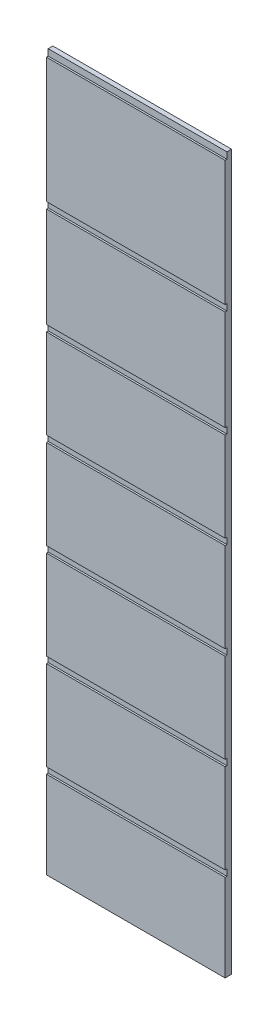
from build123d import *

# Parameters (mm, degrees)
ESBO_O1_W                = 500
ESBO_O1_H                = 2000
RESSALTO_EXTRUS_O1_DEPTH = 9
ESBO_O2_W                = 500
ESBO_O2_H                = 18
ESBO_O2_W_2              = 500.189841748
CORTE_EXTRUS_O1_DEPTH    = 5


with BuildPart() as part:
    # Esbo_o1 → Ressalto-extrus_o1 (new, symmetric)
    with BuildSketch(Plane.XY):
        Rectangle(ESBO_O1_W, ESBO_O1_H)
    extrude(amount=RESSALTO_EXTRUS_O1_DEPTH, both=True)

    # Esbo_o2 → Corte-extrus_o1 (cut)
    with BuildSketch(Plane.XY.offset(9)):
        with Locations((0, 991)):
            Rectangle(ESBO_O2_W, ESBO_O2_H)
        with Locations((0, 623)):
            Rectangle(ESBO_O2_W, ESBO_O2_H)
        with Locations((0, 325)):
            Rectangle(ESBO_O2_W, ESBO_O2_H)
        with Locations((-0.094920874, 57)):
            Rectangle(ESBO_O2_W_2, ESBO_O2_H)
        with Locations((0, -211)):
            Rectangle(ESBO_O2_W, ESBO_O2_H)
        with Locations((0, -479)):
            Rectangle(ESBO_O2_W, ESBO_O2_H)
        with Locations((0, -747)):
            Rectangle(ESBO_O2_W, ESBO_O2_H)
    extrude(amount=-CORTE_EXTRUS_O1_DEPTH, mode=Mode.SUBTRACT)


solid = part.part
